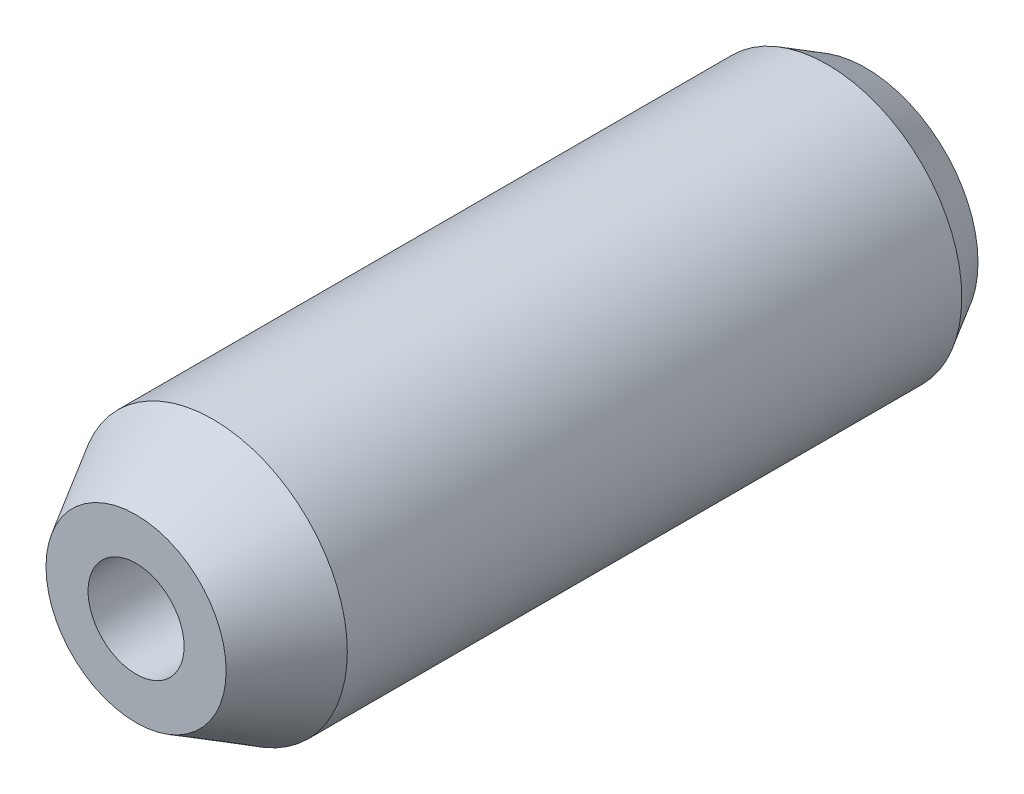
ISO-10303-21;
HEADER;
FILE_DESCRIPTION(('STEP AP214'),'2;1');
FILE_NAME('part.step','',(''),(''),'','','');
FILE_SCHEMA(('AUTOMOTIVE_DESIGN { 1 0 10303 214 1 1 1 1 }'));
ENDSEC;
DATA;
#1=APPLICATION_CONTEXT('core data for automotive mechanical design processes');
#2=APPLICATION_PROTOCOL_DEFINITION('international standard','automotive_design',2000,#1);
#3=PRODUCT_CONTEXT('',#1,'mechanical');
#4=PRODUCT('Part','Part','',(#3));
#5=PRODUCT_RELATED_PRODUCT_CATEGORY('part','',(#4));
#6=PRODUCT_DEFINITION_FORMATION('','',#4);
#7=PRODUCT_DEFINITION_CONTEXT('part definition',#1,'design');
#8=PRODUCT_DEFINITION('design','',#6,#7);
#9=PRODUCT_DEFINITION_SHAPE('','',#8);
#10=(LENGTH_UNIT() NAMED_UNIT(*) SI_UNIT(.MILLI.,.METRE.));
#11=(NAMED_UNIT(*) PLANE_ANGLE_UNIT() SI_UNIT($,.RADIAN.));
#12=(NAMED_UNIT(*) SI_UNIT($,.STERADIAN.) SOLID_ANGLE_UNIT());
#13=UNCERTAINTY_MEASURE_WITH_UNIT(LENGTH_MEASURE(1.E-05),#10,'distance_accuracy_value','');
#14=(GEOMETRIC_REPRESENTATION_CONTEXT(3) GLOBAL_UNCERTAINTY_ASSIGNED_CONTEXT((#13)) GLOBAL_UNIT_ASSIGNED_CONTEXT((#10,
#11,#12)) REPRESENTATION_CONTEXT('',''));
#15=CARTESIAN_POINT('',(0.,0.,0.));
#16=DIRECTION('',(0.,0.,1.));
#17=DIRECTION('',(1.,0.,0.));
#18=AXIS2_PLACEMENT_3D('',#15,#16,#17);
#19=CARTESIAN_POINT('',(0.,0.,0.));
#20=DIRECTION('',(0.,0.,1.));
#21=DIRECTION('',(1.,0.,0.));
#22=AXIS2_PLACEMENT_3D('',#19,#20,#21);
#23=PLANE('',#22);
#24=CARTESIAN_POINT('',(0.,0.,0.));
#25=DIRECTION('',(0.,0.,1.));
#26=DIRECTION('',(1.,0.,0.));
#27=AXIS2_PLACEMENT_3D('',#24,#25,#26);
#28=CIRCLE('',#27,5.84529946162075);
#29=CARTESIAN_POINT('',(5.84529946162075,0.,0.));
#30=VERTEX_POINT('',#29);
#31=EDGE_CURVE('E8',#30,#30,#28,.T.);
#32=ORIENTED_EDGE('',*,*,#31,.F.);
#33=EDGE_LOOP('',(#32));
#34=FACE_BOUND('',#33,.T.);
#35=ADVANCED_FACE('F12',(#34),#23,.F.);
#36=CARTESIAN_POINT('',(0.,0.,2.));
#37=DIRECTION('',(0.,0.,1.));
#38=DIRECTION('',(1.,0.,0.));
#39=AXIS2_PLACEMENT_3D('',#36,#37,#38);
#40=CONICAL_SURFACE('',#39,7.,0.523598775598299);
#41=ORIENTED_EDGE('',*,*,#31,.T.);
#42=EDGE_LOOP('',(#41));
#43=FACE_BOUND('',#42,.T.);
#44=CARTESIAN_POINT('',(0.,0.,2.));
#45=DIRECTION('',(0.,0.,1.));
#46=DIRECTION('',(1.,0.,0.));
#47=AXIS2_PLACEMENT_3D('',#44,#45,#46);
#48=CIRCLE('',#47,7.);
#49=CARTESIAN_POINT('',(7.,0.,2.));
#50=VERTEX_POINT('',#49);
#51=EDGE_CURVE('E18',#50,#50,#48,.T.);
#52=ORIENTED_EDGE('',*,*,#51,.F.);
#53=EDGE_LOOP('',(#52));
#54=FACE_BOUND('',#53,.T.);
#55=ADVANCED_FACE('F60',(#43,#54),#40,.T.);
#56=CARTESIAN_POINT('',(0.,0.,50.));
#57=DIRECTION('',(0.,0.,1.));
#58=DIRECTION('',(1.,0.,0.));
#59=AXIS2_PLACEMENT_3D('',#56,#57,#58);
#60=CYLINDRICAL_SURFACE('',#59,7.);
#61=CARTESIAN_POINT('',(0.,0.,34.));
#62=DIRECTION('',(0.,0.,1.));
#63=DIRECTION('',(1.,0.,0.));
#64=AXIS2_PLACEMENT_3D('',#61,#62,#63);
#65=CIRCLE('',#64,7.);
#66=CARTESIAN_POINT('',(7.,0.,34.));
#67=VERTEX_POINT('',#66);
#68=EDGE_CURVE('E22',#67,#67,#65,.T.);
#69=ORIENTED_EDGE('',*,*,#68,.F.);
#70=EDGE_LOOP('',(#69));
#71=FACE_BOUND('',#70,.T.);
#72=ORIENTED_EDGE('',*,*,#51,.T.);
#73=EDGE_LOOP('',(#72));
#74=FACE_BOUND('',#73,.T.);
#75=ADVANCED_FACE('F55',(#71,#74),#60,.T.);
#76=CARTESIAN_POINT('',(0.,0.,34.));
#77=DIRECTION('',(0.,0.,-1.));
#78=DIRECTION('',(-1.,0.,0.));
#79=AXIS2_PLACEMENT_3D('',#76,#77,#78);
#80=CONICAL_SURFACE('',#79,7.,0.523598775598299);
#81=CARTESIAN_POINT('',(0.,0.,38.));
#82=DIRECTION('',(0.,0.,1.));
#83=DIRECTION('',(1.,0.,0.));
#84=AXIS2_PLACEMENT_3D('',#81,#82,#83);
#85=CIRCLE('',#84,4.69059892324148);
#86=CARTESIAN_POINT('',(4.69059892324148,0.,38.));
#87=VERTEX_POINT('',#86);
#88=EDGE_CURVE('E26',#87,#87,#85,.T.);
#89=ORIENTED_EDGE('',*,*,#88,.F.);
#90=EDGE_LOOP('',(#89));
#91=FACE_BOUND('',#90,.T.);
#92=ORIENTED_EDGE('',*,*,#68,.T.);
#93=EDGE_LOOP('',(#92));
#94=FACE_BOUND('',#93,.T.);
#95=ADVANCED_FACE('F49',(#91,#94),#80,.T.);
#96=CARTESIAN_POINT('',(4.69059892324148,0.,38.));
#97=DIRECTION('',(0.,0.,-1.));
#98=DIRECTION('',(-1.,0.,0.));
#99=AXIS2_PLACEMENT_3D('',#96,#97,#98);
#100=PLANE('',#99);
#101=CARTESIAN_POINT('',(0.,0.,38.));
#102=DIRECTION('',(0.,0.,1.));
#103=DIRECTION('',(1.,0.,0.));
#104=AXIS2_PLACEMENT_3D('',#101,#102,#103);
#105=CIRCLE('',#104,2.5);
#106=CARTESIAN_POINT('',(2.5,0.,38.));
#107=VERTEX_POINT('',#106);
#108=EDGE_CURVE('E31',#107,#107,#105,.T.);
#109=ORIENTED_EDGE('',*,*,#108,.F.);
#110=EDGE_LOOP('',(#109));
#111=FACE_BOUND('',#110,.T.);
#112=ORIENTED_EDGE('',*,*,#88,.T.);
#113=EDGE_LOOP('',(#112));
#114=FACE_BOUND('',#113,.T.);
#115=ADVANCED_FACE('F43',(#111,#114),#100,.F.);
#116=CARTESIAN_POINT('',(0.,0.,50.));
#117=DIRECTION('',(0.,0.,1.));
#118=DIRECTION('',(1.,0.,0.));
#119=AXIS2_PLACEMENT_3D('',#116,#117,#118);
#120=CYLINDRICAL_SURFACE('',#119,2.5);
#121=CARTESIAN_POINT('',(0.,0.,28.));
#122=DIRECTION('',(0.,0.,1.));
#123=DIRECTION('',(1.,0.,0.));
#124=AXIS2_PLACEMENT_3D('',#121,#122,#123);
#125=CIRCLE('',#124,2.5);
#126=CARTESIAN_POINT('',(2.5,0.,28.));
#127=VERTEX_POINT('',#126);
#128=EDGE_CURVE('E34',#127,#127,#125,.T.);
#129=ORIENTED_EDGE('',*,*,#128,.F.);
#130=EDGE_LOOP('',(#129));
#131=FACE_BOUND('',#130,.T.);
#132=ORIENTED_EDGE('',*,*,#108,.T.);
#133=EDGE_LOOP('',(#132));
#134=FACE_BOUND('',#133,.T.);
#135=ADVANCED_FACE('F40',(#131,#134),#120,.F.);
#136=CARTESIAN_POINT('',(0.,0.,28.));
#137=DIRECTION('',(0.,0.,1.));
#138=DIRECTION('',(1.,0.,0.));
#139=AXIS2_PLACEMENT_3D('',#136,#137,#138);
#140=PLANE('',#139);
#141=ORIENTED_EDGE('',*,*,#128,.T.);
#142=EDGE_LOOP('',(#141));
#143=FACE_BOUND('',#142,.T.);
#144=ADVANCED_FACE('F38',(#143),#140,.T.);
#145=CLOSED_SHELL('',(#35,#55,#75,#95,#115,#135,#144));
#146=MANIFOLD_SOLID_BREP('B1',#145);
#147=ADVANCED_BREP_SHAPE_REPRESENTATION('',(#18,#146),#14);
#148=SHAPE_DEFINITION_REPRESENTATION(#9,#147);
ENDSEC;
END-ISO-10303-21;
